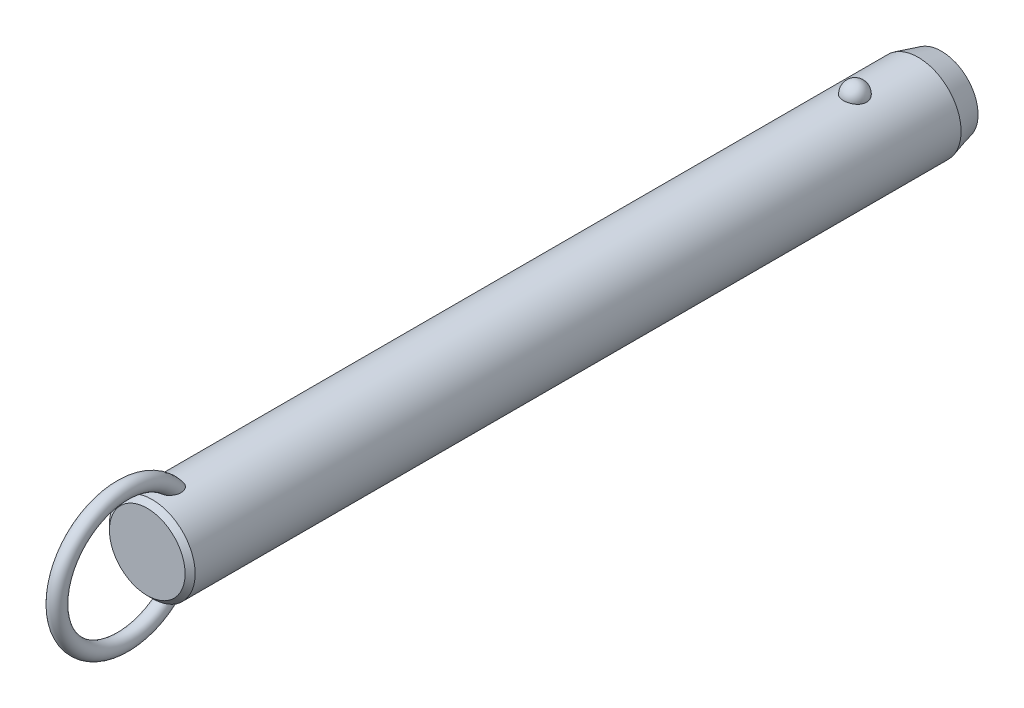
ISO-10303-21;
HEADER;
FILE_DESCRIPTION(('STEP AP214'),'2;1');
FILE_NAME('part.step','',(''),(''),'','','');
FILE_SCHEMA(('AUTOMOTIVE_DESIGN { 1 0 10303 214 1 1 1 1 }'));
ENDSEC;
DATA;
#1=APPLICATION_CONTEXT('core data for automotive mechanical design processes');
#2=APPLICATION_PROTOCOL_DEFINITION('international standard','automotive_design',2000,#1);
#3=PRODUCT_CONTEXT('',#1,'mechanical');
#4=PRODUCT('Part','Part','',(#3));
#5=PRODUCT_RELATED_PRODUCT_CATEGORY('part','',(#4));
#6=PRODUCT_DEFINITION_FORMATION('','',#4);
#7=PRODUCT_DEFINITION_CONTEXT('part definition',#1,'design');
#8=PRODUCT_DEFINITION('design','',#6,#7);
#9=PRODUCT_DEFINITION_SHAPE('','',#8);
#10=(LENGTH_UNIT() NAMED_UNIT(*) SI_UNIT(.MILLI.,.METRE.));
#11=(NAMED_UNIT(*) PLANE_ANGLE_UNIT() SI_UNIT($,.RADIAN.));
#12=(NAMED_UNIT(*) SI_UNIT($,.STERADIAN.) SOLID_ANGLE_UNIT());
#13=UNCERTAINTY_MEASURE_WITH_UNIT(LENGTH_MEASURE(1.E-05),#10,'distance_accuracy_value','');
#14=(GEOMETRIC_REPRESENTATION_CONTEXT(3) GLOBAL_UNCERTAINTY_ASSIGNED_CONTEXT((#13)) GLOBAL_UNIT_ASSIGNED_CONTEXT((#10,
#11,#12)) REPRESENTATION_CONTEXT('',''));
#15=CARTESIAN_POINT('',(0.,0.,0.));
#16=DIRECTION('',(0.,0.,1.));
#17=DIRECTION('',(1.,0.,0.));
#18=AXIS2_PLACEMENT_3D('',#15,#16,#17);
#19=CARTESIAN_POINT('',(0.,0.,167.6));
#20=DIRECTION('',(0.,0.,-1.));
#21=DIRECTION('',(-1.,0.,0.));
#22=AXIS2_PLACEMENT_3D('',#19,#20,#21);
#23=CYLINDRICAL_SURFACE('',#22,11.1);
#24=CARTESIAN_POINT('',(2.9724815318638,10.6945945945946,-3.00000000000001));
#25=CARTESIAN_POINT('',(2.97247830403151,10.6945972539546,-2.8322505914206));
#26=CARTESIAN_POINT('',(2.95876598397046,10.6984356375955,-2.66445972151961));
#27=CARTESIAN_POINT('',(2.90424529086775,10.7133624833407,-2.3336238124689));
#28=CARTESIAN_POINT('',(2.8634252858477,10.7244540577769,-2.17058084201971));
#29=CARTESIAN_POINT('',(2.75573657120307,10.7526272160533,-1.85396767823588));
#30=CARTESIAN_POINT('',(2.68887937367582,10.7697061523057,-1.70039333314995));
#31=CARTESIAN_POINT('',(2.53079696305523,10.8079438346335,-1.4069159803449));
#32=CARTESIAN_POINT('',(2.43957264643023,10.8291024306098,-1.26701246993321));
#33=CARTESIAN_POINT('',(2.23458150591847,10.8732541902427,-1.00409565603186));
#34=CARTESIAN_POINT('',(2.12071295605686,10.8962553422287,-0.881162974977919));
#35=CARTESIAN_POINT('',(1.87365402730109,10.9414421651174,-0.656352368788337));
#36=CARTESIAN_POINT('',(1.74046358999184,10.9636278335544,-0.554474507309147));
#37=CARTESIAN_POINT('',(1.45872188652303,11.0046495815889,-0.374872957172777));
#38=CARTESIAN_POINT('',(1.31021276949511,11.0234944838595,-0.297085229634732));
#39=CARTESIAN_POINT('',(1.00170030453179,11.0557957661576,-0.167529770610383));
#40=CARTESIAN_POINT('',(0.841698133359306,11.0692526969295,-0.1157593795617));
#41=CARTESIAN_POINT('',(0.517607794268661,11.0890932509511,-0.0403925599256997));
#42=CARTESIAN_POINT('',(0.353633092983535,11.0955916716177,-0.0163383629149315));
#43=CARTESIAN_POINT('',(0.0238420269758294,11.1011989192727,0.00445177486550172));
#44=CARTESIAN_POINT('',(-0.141974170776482,11.1003084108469,0.00119017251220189));
#45=CARTESIAN_POINT('',(-0.468405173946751,11.0912990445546,-0.0323233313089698));
#46=CARTESIAN_POINT('',(-0.629059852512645,11.0832767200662,-0.062214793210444));
#47=CARTESIAN_POINT('',(-0.942937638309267,11.0609962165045,-0.147645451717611));
#48=CARTESIAN_POINT('',(-1.09616062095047,11.0467379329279,-0.203185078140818));
#49=CARTESIAN_POINT('',(-1.39181061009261,11.0134071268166,-0.338752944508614));
#50=CARTESIAN_POINT('',(-1.53417383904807,10.9943086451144,-0.418913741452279));
#51=CARTESIAN_POINT('',(-1.80342160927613,10.9533667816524,-0.601448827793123));
#52=CARTESIAN_POINT('',(-1.9303046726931,10.9315231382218,-0.703825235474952));
#53=CARTESIAN_POINT('',(-2.16747598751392,10.887005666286,-0.930091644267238));
#54=CARTESIAN_POINT('',(-2.27742774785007,10.8643239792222,-1.05433291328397));
#55=CARTESIAN_POINT('',(-2.47517316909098,10.8209886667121,-1.31966633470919));
#56=CARTESIAN_POINT('',(-2.56296538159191,10.8003351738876,-1.46075958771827));
#57=CARTESIAN_POINT('',(-2.71500300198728,10.7631304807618,-1.75753646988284));
#58=CARTESIAN_POINT('',(-2.77898901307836,10.7466250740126,-1.91335887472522));
#59=CARTESIAN_POINT('',(-2.88046189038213,10.7198747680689,-2.23391529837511));
#60=CARTESIAN_POINT('',(-2.91794947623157,10.709629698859,-2.3986490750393));
#61=CARTESIAN_POINT('',(-2.96537819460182,10.6965949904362,-2.73165170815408));
#62=CARTESIAN_POINT('',(-2.97542891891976,10.693775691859,-2.89990378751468));
#63=CARTESIAN_POINT('',(-2.96804271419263,10.6958279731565,-3.23575286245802));
#64=CARTESIAN_POINT('',(-2.95060646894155,10.7006993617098,-3.4033498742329));
#65=CARTESIAN_POINT('',(-2.88883358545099,10.71753912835,-3.73233906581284));
#66=CARTESIAN_POINT('',(-2.84462026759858,10.7294749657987,-3.89375610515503));
#67=CARTESIAN_POINT('',(-2.73050447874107,10.7590797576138,-4.20667949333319));
#68=CARTESIAN_POINT('',(-2.66060103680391,10.7767489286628,-4.35818546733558));
#69=CARTESIAN_POINT('',(-2.49642559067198,10.8159599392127,-4.64785421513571));
#70=CARTESIAN_POINT('',(-2.40203047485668,10.8375211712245,-4.78594458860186));
#71=CARTESIAN_POINT('',(-2.19143488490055,10.8820570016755,-5.04410382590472));
#72=CARTESIAN_POINT('',(-2.07523364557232,10.9050316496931,-5.16417205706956));
#73=CARTESIAN_POINT('',(-1.82361254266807,10.9499219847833,-5.3833483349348));
#74=CARTESIAN_POINT('',(-1.68812945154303,10.9718338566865,-5.48238464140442));
#75=CARTESIAN_POINT('',(-1.40191298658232,11.0120611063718,-5.65618873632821));
#76=CARTESIAN_POINT('',(-1.25118062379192,11.0303767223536,-5.73095813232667));
#77=CARTESIAN_POINT('',(-0.940570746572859,11.0611653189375,-5.85334725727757));
#78=CARTESIAN_POINT('',(-0.780821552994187,11.0737044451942,-5.90127578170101));
#79=CARTESIAN_POINT('',(-0.455204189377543,11.0918598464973,-5.96992976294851));
#80=CARTESIAN_POINT('',(-0.289336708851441,11.0974768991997,-5.99065827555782));
#81=CARTESIAN_POINT('',(0.0406846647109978,11.1011307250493,-6.00418773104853));
#82=CARTESIAN_POINT('',(0.204817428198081,11.099299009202,-5.9974731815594));
#83=CARTESIAN_POINT('',(0.5295530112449,11.088551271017,-5.95740317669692));
#84=CARTESIAN_POINT('',(0.69015594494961,11.0796354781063,-5.92404858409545));
#85=CARTESIAN_POINT('',(1.0027760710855,11.0557204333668,-5.83180084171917));
#86=CARTESIAN_POINT('',(1.15482001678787,11.0407414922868,-5.7729929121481));
#87=CARTESIAN_POINT('',(1.44678373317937,11.0062913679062,-5.63147366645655));
#88=CARTESIAN_POINT('',(1.58670279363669,10.9868199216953,-5.54876095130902));
#89=CARTESIAN_POINT('',(1.8527023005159,10.9451315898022,-5.36027644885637));
#90=CARTESIAN_POINT('',(1.97855158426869,10.9228788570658,-5.25418644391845));
#91=CARTESIAN_POINT('',(2.21080872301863,10.8782509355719,-5.02251354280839));
#92=CARTESIAN_POINT('',(2.31721312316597,10.8558757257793,-4.89692718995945));
#93=CARTESIAN_POINT('',(2.5094551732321,10.8130715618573,-4.62745408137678));
#94=CARTESIAN_POINT('',(2.59493284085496,10.7926798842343,-4.48330448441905));
#95=CARTESIAN_POINT('',(2.740862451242,10.7565495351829,-4.18236358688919));
#96=CARTESIAN_POINT('',(2.80132490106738,10.7408089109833,-4.02557762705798));
#97=CARTESIAN_POINT('',(2.88959070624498,10.7173718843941,-3.72475308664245));
#98=CARTESIAN_POINT('',(2.92062102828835,10.7088950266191,-3.58171216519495));
#99=CARTESIAN_POINT('',(2.96206765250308,10.6975052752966,-3.29245795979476));
#100=CARTESIAN_POINT('',(2.97248434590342,10.6945922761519,-3.14624473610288));
#101=CARTESIAN_POINT('',(2.9724815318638,10.6945945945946,-3.00000000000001));
#102=B_SPLINE_CURVE_WITH_KNOTS('',3,(#24,#25,#26,#27,#28,#29,#30,#31,#32,#33,#34,#35,#36,#37,
#38,#39,#40,#41,#42,#43,#44,#45,#46,#47,#48,#49,#50,#51,#52,#53,#54,#55,#56,#57,#58,#59,#60,#61,
#62,#63,#64,#65,#66,#67,#68,#69,#70,#71,#72,#73,#74,#75,#76,#77,#78,#79,#80,#81,#82,#83,#84,#85,
#86,#87,#88,#89,#90,#91,#92,#93,#94,#95,#96,#97,#98,#99,#100,#101),.UNSPECIFIED.,.T.,.F.,(4,2,2,
2,2,2,2,2,2,2,2,2,2,2,2,2,2,2,2,2,2,2,2,2,2,2,2,2,2,2,2,2,2,2,2,2,2,2,4),(0.,0.502722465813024,
1.00566079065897,1.5083769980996,2.01107471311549,2.51608392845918,3.02109467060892,
3.52475118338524,4.02835620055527,4.523518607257,5.0186364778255,5.50715297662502,
5.9956776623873,6.48688002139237,6.97812923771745,7.47814366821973,7.9781907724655,
8.48353712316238,8.9888697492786,9.49218093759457,9.99547960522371,10.4964777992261,
10.997494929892,11.5010810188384,12.0046847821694,12.5099796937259,13.0152411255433,
13.5145635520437,14.0138298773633,14.5043200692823,14.9947943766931,15.4836390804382,
15.9725123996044,16.4685040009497,16.9645836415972,17.4686765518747,17.972557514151,
18.410841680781,18.849117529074),.UNSPECIFIED.);
#103=CARTESIAN_POINT('',(2.9724815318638,10.6945945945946,-3.00000000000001));
#104=VERTEX_POINT('',#103);
#105=EDGE_CURVE('E41',#104,#104,#102,.T.);
#106=ORIENTED_EDGE('',*,*,#105,.T.);
#107=EDGE_LOOP('',(#106));
#108=FACE_BOUND('',#107,.T.);
#109=CARTESIAN_POINT('',(0.,0.,179.));
#110=DIRECTION('',(0.,0.,1.));
#111=DIRECTION('',(1.,0.,0.));
#112=AXIS2_PLACEMENT_3D('',#109,#110,#111);
#113=CIRCLE('',#112,11.1);
#114=CARTESIAN_POINT('',(11.1,0.,179.));
#115=VERTEX_POINT('',#114);
#116=EDGE_CURVE('E10',#115,#115,#113,.F.);
#117=ORIENTED_EDGE('',*,*,#116,.T.);
#118=EDGE_LOOP('',(#117));
#119=FACE_BOUND('',#118,.T.);
#120=CARTESIAN_POINT('',(-0.564520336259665,-11.0856356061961,171.257815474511));
#121=CARTESIAN_POINT('',(-0.667202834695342,-11.0804062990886,171.291283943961));
#122=CARTESIAN_POINT('',(-0.766875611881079,-11.0738877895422,171.333835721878));
#123=CARTESIAN_POINT('',(-0.957284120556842,-11.0590576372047,171.435419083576));
#124=CARTESIAN_POINT('',(-1.04801616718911,-11.0507452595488,171.49445742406));
#125=CARTESIAN_POINT('',(-1.21800952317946,-11.0333016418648,171.626529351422));
#126=CARTESIAN_POINT('',(-1.29730805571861,-11.0241732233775,171.699515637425));
#127=CARTESIAN_POINT('',(-1.44337665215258,-11.0060026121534,171.857037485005));
#128=CARTESIAN_POINT('',(-1.51014622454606,-10.9969604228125,171.941573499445));
#129=CARTESIAN_POINT('',(-1.63454620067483,-10.9791841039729,172.125521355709));
#130=CARTESIAN_POINT('',(-1.69127003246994,-10.9705107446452,172.225549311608));
#131=CARTESIAN_POINT('',(-1.7898078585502,-10.9548648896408,172.432790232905));
#132=CARTESIAN_POINT('',(-1.83161214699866,-10.9478935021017,172.540007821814));
#133=CARTESIAN_POINT('',(-1.91557028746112,-10.9335803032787,172.805408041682));
#134=CARTESIAN_POINT('',(-1.95040620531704,-10.9273269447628,172.965980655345));
#135=CARTESIAN_POINT('',(-1.99388326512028,-10.9194709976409,173.290697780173));
#136=CARTESIAN_POINT('',(-2.00248051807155,-10.9178762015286,173.454847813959));
#137=CARTESIAN_POINT('',(-1.99551615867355,-10.9191578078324,173.824650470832));
#138=CARTESIAN_POINT('',(-1.9732206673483,-10.9232807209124,174.030191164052));
#139=CARTESIAN_POINT('',(-1.9152976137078,-10.9335244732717,174.333595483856));
#140=CARTESIAN_POINT('',(-1.89184575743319,-10.9376266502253,174.434088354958));
#141=CARTESIAN_POINT('',(-1.83700674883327,-10.9469720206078,174.632855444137));
#142=CARTESIAN_POINT('',(-1.80562070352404,-10.9522150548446,174.731129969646));
#143=CARTESIAN_POINT('',(-1.73463055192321,-10.9636837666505,174.925914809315));
#144=CARTESIAN_POINT('',(-1.69493416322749,-10.9699202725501,175.022390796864));
#145=CARTESIAN_POINT('',(-1.60745141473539,-10.9830806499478,175.211626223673));
#146=CARTESIAN_POINT('',(-1.55966150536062,-10.9900048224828,175.304384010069));
#147=CARTESIAN_POINT('',(-1.45591812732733,-11.0042280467,175.484690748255));
#148=CARTESIAN_POINT('',(-1.40000013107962,-11.0115253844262,175.572260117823));
#149=CARTESIAN_POINT('',(-1.27937470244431,-11.0261911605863,175.741029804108));
#150=CARTESIAN_POINT('',(-1.21467835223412,-11.0335594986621,175.82223795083));
#151=CARTESIAN_POINT('',(-1.08218150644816,-11.0473027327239,175.969001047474));
#152=CARTESIAN_POINT('',(-1.01522633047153,-11.0537063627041,176.035309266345));
#153=CARTESIAN_POINT('',(-0.872952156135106,-11.065850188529,176.158378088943));
#154=CARTESIAN_POINT('',(-0.797642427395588,-11.0715911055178,176.215149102));
#155=CARTESIAN_POINT('',(-0.651396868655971,-11.081071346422,176.307515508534));
#156=CARTESIAN_POINT('',(-0.581712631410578,-11.0849841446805,176.345049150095));
#157=CARTESIAN_POINT('',(-0.437066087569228,-11.0916271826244,176.408259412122));
#158=CARTESIAN_POINT('',(-0.362109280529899,-11.0943586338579,176.433948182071));
#159=CARTESIAN_POINT('',(-0.207828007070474,-11.0983242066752,176.471117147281));
#160=CARTESIAN_POINT('',(-0.12846771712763,-11.0995432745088,176.482454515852));
#161=CARTESIAN_POINT('',(0.0309101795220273,-11.1002423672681,176.488965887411));
#162=CARTESIAN_POINT('',(0.110927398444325,-11.0997233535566,176.484148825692));
#163=CARTESIAN_POINT('',(0.25640659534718,-11.097240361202,176.460959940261));
#164=CARTESIAN_POINT('',(0.322235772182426,-11.0955074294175,176.444754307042));
#165=CARTESIAN_POINT('',(0.450635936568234,-11.0910350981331,176.402600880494));
#166=CARTESIAN_POINT('',(0.513205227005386,-11.0882951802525,176.376648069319));
#167=CARTESIAN_POINT('',(0.662626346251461,-11.0805620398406,176.302607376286));
#168=CARTESIAN_POINT('',(0.747127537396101,-11.0751144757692,176.249845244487));
#169=CARTESIAN_POINT('',(0.906756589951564,-11.0631932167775,176.131720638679));
#170=CARTESIAN_POINT('',(0.981859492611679,-11.0567168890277,176.066325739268));
#171=CARTESIAN_POINT('',(1.10712207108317,-11.0447856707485,175.94226337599));
#172=CARTESIAN_POINT('',(1.15909566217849,-11.0394280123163,175.885383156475));
#173=CARTESIAN_POINT('',(1.25791923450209,-11.0286040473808,175.767327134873));
#174=CARTESIAN_POINT('',(1.30476642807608,-11.0231376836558,175.706149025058));
#175=CARTESIAN_POINT('',(1.43818612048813,-11.0068027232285,175.517305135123));
#176=CARTESIAN_POINT('',(1.51751767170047,-10.9960104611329,175.384453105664));
#177=CARTESIAN_POINT('',(1.63597546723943,-10.9788847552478,175.153137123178));
#178=CARTESIAN_POINT('',(1.67988876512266,-10.9722190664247,175.057053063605));
#179=CARTESIAN_POINT('',(1.75953241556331,-10.9597298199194,174.861431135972));
#180=CARTESIAN_POINT('',(1.79525967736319,-10.9539065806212,174.761891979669));
#181=CARTESIAN_POINT('',(1.85844731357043,-10.9433632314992,174.56021118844));
#182=CARTESIAN_POINT('',(1.8859107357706,-10.9386427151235,174.45807052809));
#183=CARTESIAN_POINT('',(1.93234324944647,-10.9305350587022,174.251819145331));
#184=CARTESIAN_POINT('',(1.95131065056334,-10.9271481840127,174.147708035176));
#185=CARTESIAN_POINT('',(1.9904020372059,-10.9201183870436,173.865458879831));
#186=CARTESIAN_POINT('',(2.00221217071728,-10.9179256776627,173.686037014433));
#187=CARTESIAN_POINT('',(1.99711676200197,-10.9188636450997,173.327713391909));
#188=CARTESIAN_POINT('',(1.98026150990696,-10.9219849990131,173.148811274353));
#189=CARTESIAN_POINT('',(1.92151657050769,-10.9324473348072,172.83645144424));
#190=CARTESIAN_POINT('',(1.88605081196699,-10.9386915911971,172.701759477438));
#191=CARTESIAN_POINT('',(1.79393020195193,-10.9541780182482,172.439966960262));
#192=CARTESIAN_POINT('',(1.73729868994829,-10.9634168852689,172.312858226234));
#193=CARTESIAN_POINT('',(1.61237037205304,-10.9824218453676,172.089418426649));
#194=CARTESIAN_POINT('',(1.54715374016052,-10.9918945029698,171.991345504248));
#195=CARTESIAN_POINT('',(1.40127026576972,-11.0114415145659,171.807434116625));
#196=CARTESIAN_POINT('',(1.32060742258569,-11.0215157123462,171.721592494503));
#197=CARTESIAN_POINT('',(1.1447478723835,-11.041168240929,171.565163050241));
#198=CARTESIAN_POINT('',(1.04947805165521,-11.0507437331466,171.494656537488));
#199=CARTESIAN_POINT('',(0.847278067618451,-11.0680789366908,171.372640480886));
#200=CARTESIAN_POINT('',(0.740351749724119,-11.0758392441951,171.321124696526));
#201=CARTESIAN_POINT('',(0.529289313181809,-11.0878275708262,171.243485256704));
#202=CARTESIAN_POINT('',(0.425895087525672,-11.0923259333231,171.215377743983));
#203=CARTESIAN_POINT('',(0.215723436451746,-11.0984001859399,171.177703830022));
#204=CARTESIAN_POINT('',(0.10894793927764,-11.0999777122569,171.168127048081));
#205=CARTESIAN_POINT('',(-0.0938962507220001,-11.1000196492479,171.167877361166));
#206=CARTESIAN_POINT('',(-0.189967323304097,-11.0987797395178,171.175408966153));
#207=CARTESIAN_POINT('',(-0.379657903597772,-11.0939111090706,171.205507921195));
#208=CARTESIAN_POINT('',(-0.473277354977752,-11.0902823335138,171.228075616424));
#209=CARTESIAN_POINT('',(-0.564520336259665,-11.0856356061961,171.257815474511));
#210=B_SPLINE_CURVE_WITH_KNOTS('',3,(#120,#121,#122,#123,#124,#125,#126,#127,#128,#129,#130,
#131,#132,#133,#134,#135,#136,#137,#138,#139,#140,#141,#142,#143,#144,#145,#146,#147,#148,#149,
#150,#151,#152,#153,#154,#155,#156,#157,#158,#159,#160,#161,#162,#163,#164,#165,#166,#167,#168,
#169,#170,#171,#172,#173,#174,#175,#176,#177,#178,#179,#180,#181,#182,#183,#184,#185,#186,#187,
#188,#189,#190,#191,#192,#193,#194,#195,#196,#197,#198,#199,#200,#201,#202,#203,#204,#205,#206,
#207,#208,#209),.UNSPECIFIED.,.T.,.F.,(4,2,2,2,2,2,2,2,2,2,2,2,2,2,2,2,2,2,2,2,2,2,2,2,2,2,2,2,
2,2,2,2,2,2,2,2,2,2,2,2,2,2,2,2,4),(0.,0.323999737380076,0.648132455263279,0.971184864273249,
1.29424994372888,1.63886237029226,1.98369857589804,2.47426059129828,2.96564271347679,
3.58257396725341,3.89215258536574,4.20168803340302,4.51486273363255,4.82817514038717,
5.14015911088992,5.45175282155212,5.73442856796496,6.01679375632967,6.25364580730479,
6.49025437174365,6.72919963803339,6.96801276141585,7.17061258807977,7.37331685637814,
7.67094989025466,7.96935728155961,8.20075067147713,8.43226927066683,8.89581623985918,
9.21306533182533,9.5304340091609,9.84768549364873,10.1650000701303,10.7022930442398,
11.2386443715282,11.655339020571,12.071575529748,12.4245637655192,12.7774607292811,
13.1321855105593,13.4867936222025,13.8068771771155,14.1267813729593,14.4146787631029,
14.7025827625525),.UNSPECIFIED.);
#211=CARTESIAN_POINT('',(-0.564520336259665,-11.0856356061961,171.257815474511));
#212=VERTEX_POINT('',#211);
#213=EDGE_CURVE('E60',#212,#212,#210,.T.);
#214=ORIENTED_EDGE('',*,*,#213,.T.);
#215=EDGE_LOOP('',(#214));
#216=FACE_BOUND('',#215,.T.);
#217=CARTESIAN_POINT('',(-0.564520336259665,11.0856356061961,171.257815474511));
#218=CARTESIAN_POINT('',(-0.468542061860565,11.0905203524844,171.226545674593));
#219=CARTESIAN_POINT('',(-0.369793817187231,11.0942886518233,171.203157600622));
#220=CARTESIAN_POINT('',(-0.169555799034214,11.0991586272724,171.173085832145));
#221=CARTESIAN_POINT('',(-0.0680604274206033,11.1002543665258,171.16643932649));
#222=CARTESIAN_POINT('',(0.13454973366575,11.099646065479,171.170157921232));
#223=CARTESIAN_POINT('',(0.235664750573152,11.0979441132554,171.18051033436));
#224=CARTESIAN_POINT('',(0.434632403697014,11.0919342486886,171.217831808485));
#225=CARTESIAN_POINT('',(0.532486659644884,11.0876276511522,171.244792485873));
#226=CARTESIAN_POINT('',(0.722445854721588,11.0768742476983,171.3144096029));
#227=CARTESIAN_POINT('',(0.814543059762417,11.0704246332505,171.357086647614));
#228=CARTESIAN_POINT('',(0.990565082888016,11.0560659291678,171.456648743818));
#229=CARTESIAN_POINT('',(1.07448844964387,11.048156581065,171.513536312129));
#230=CARTESIAN_POINT('',(1.23562672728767,11.0313221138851,171.642210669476));
#231=CARTESIAN_POINT('',(1.3124268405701,11.0223686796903,171.714511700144));
#232=CARTESIAN_POINT('',(1.45398030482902,11.0045918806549,171.870042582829));
#233=CARTESIAN_POINT('',(1.51873073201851,10.9957685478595,171.953275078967));
#234=CARTESIAN_POINT('',(1.64107232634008,10.9782087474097,172.136384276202));
#235=CARTESIAN_POINT('',(1.6974317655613,10.9695572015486,172.237089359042));
#236=CARTESIAN_POINT('',(1.79515063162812,10.9539887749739,172.445626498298));
#237=CARTESIAN_POINT('',(1.83649966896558,10.9470730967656,172.55346343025));
#238=CARTESIAN_POINT('',(1.91931148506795,10.9329211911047,172.820399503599));
#239=CARTESIAN_POINT('',(1.95340104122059,10.9267904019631,172.981861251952));
#240=CARTESIAN_POINT('',(1.99526195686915,10.9192174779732,173.30821631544));
#241=CARTESIAN_POINT('',(2.00298989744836,10.9177830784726,173.47311484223));
#242=CARTESIAN_POINT('',(1.99396251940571,10.9194420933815,173.844100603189));
#243=CARTESIAN_POINT('',(1.97050829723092,10.923774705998,174.05003871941));
#244=CARTESIAN_POINT('',(1.91079643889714,10.9343131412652,174.353901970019));
#245=CARTESIAN_POINT('',(1.88673702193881,10.9385106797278,174.454529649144));
#246=CARTESIAN_POINT('',(1.8306550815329,10.9480376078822,174.653510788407));
#247=CARTESIAN_POINT('',(1.79863369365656,10.9533668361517,174.751864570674));
#248=CARTESIAN_POINT('',(1.72633365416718,10.9649954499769,174.946720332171));
#249=CARTESIAN_POINT('',(1.68596409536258,10.9713053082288,175.04318790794));
#250=CARTESIAN_POINT('',(1.59707998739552,10.9845964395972,175.232323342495));
#251=CARTESIAN_POINT('',(1.54856169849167,10.9915780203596,175.324989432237));
#252=CARTESIAN_POINT('',(1.44330168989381,11.0058935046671,175.504975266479));
#253=CARTESIAN_POINT('',(1.3865974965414,11.0132257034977,175.592316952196));
#254=CARTESIAN_POINT('',(1.26431158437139,11.0279330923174,175.760456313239));
#255=CARTESIAN_POINT('',(1.19874160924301,11.0353082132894,175.841262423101));
#256=CARTESIAN_POINT('',(1.06542088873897,11.048931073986,175.985985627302));
#257=CARTESIAN_POINT('',(0.998640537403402,11.0552153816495,176.050784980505));
#258=CARTESIAN_POINT('',(0.856896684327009,11.0671032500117,176.170846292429));
#259=CARTESIAN_POINT('',(0.781942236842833,11.0727075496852,176.226118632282));
#260=CARTESIAN_POINT('',(0.636276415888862,11.081949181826,176.315972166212));
#261=CARTESIAN_POINT('',(0.566755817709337,11.0857572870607,176.352441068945));
#262=CARTESIAN_POINT('',(0.42260242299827,11.0921860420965,176.413533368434));
#263=CARTESIAN_POINT('',(0.347974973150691,11.0948079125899,176.438168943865));
#264=CARTESIAN_POINT('',(0.194593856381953,11.0985608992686,176.473323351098));
#265=CARTESIAN_POINT('',(0.115807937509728,11.0996777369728,176.483706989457));
#266=CARTESIAN_POINT('',(-0.0422499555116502,11.1002003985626,176.488574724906));
#267=CARTESIAN_POINT('',(-0.121521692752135,11.09960699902,176.483066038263));
#268=CARTESIAN_POINT('',(-0.266046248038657,11.0970123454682,176.458827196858));
#269=CARTESIAN_POINT('',(-0.331661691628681,11.0952283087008,176.442135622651));
#270=CARTESIAN_POINT('',(-0.45958809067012,11.0906663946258,176.399111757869));
#271=CARTESIAN_POINT('',(-0.52189737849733,11.0878880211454,176.372774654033));
#272=CARTESIAN_POINT('',(-0.671446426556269,11.0800342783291,176.297513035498));
#273=CARTESIAN_POINT('',(-0.756250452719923,11.0744969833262,176.243818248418));
#274=CARTESIAN_POINT('',(-0.916349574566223,11.0624045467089,176.123802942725));
#275=CARTESIAN_POINT('',(-0.991618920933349,11.0558467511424,176.057449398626));
#276=CARTESIAN_POINT('',(-1.11713140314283,11.0437783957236,175.931633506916));
#277=CARTESIAN_POINT('',(-1.16920539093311,11.0383619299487,175.873952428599));
#278=CARTESIAN_POINT('',(-1.26817476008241,11.02743010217,175.754280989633));
#279=CARTESIAN_POINT('',(-1.31506731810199,11.0219146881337,175.692288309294));
#280=CARTESIAN_POINT('',(-1.40399813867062,11.0109399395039,175.564784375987));
#281=CARTESIAN_POINT('',(-1.44602864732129,11.0054807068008,175.499267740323));
#282=CARTESIAN_POINT('',(-1.52538779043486,10.9947621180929,175.365422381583));
#283=CARTESIAN_POINT('',(-1.56271516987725,10.9895028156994,175.297092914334));
#284=CARTESIAN_POINT('',(-1.64537943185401,10.9774790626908,175.133210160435));
#285=CARTESIAN_POINT('',(-1.68879497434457,10.9708503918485,175.0366735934));
#286=CARTESIAN_POINT('',(-1.76740738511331,10.9584602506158,174.840236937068));
#287=CARTESIAN_POINT('',(-1.80260120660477,10.95269910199,174.74033561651));
#288=CARTESIAN_POINT('',(-1.86468657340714,10.9423003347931,174.537966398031));
#289=CARTESIAN_POINT('',(-1.8915816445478,10.9376622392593,174.435499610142));
#290=CARTESIAN_POINT('',(-1.93682458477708,10.9297405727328,174.228642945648));
#291=CARTESIAN_POINT('',(-1.95517082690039,10.9264572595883,174.124252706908));
#292=CARTESIAN_POINT('',(-1.99232562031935,10.9197647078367,173.84262876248));
#293=CARTESIAN_POINT('',(-2.00294603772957,10.9177914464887,173.664185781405));
#294=CARTESIAN_POINT('',(-1.99566675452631,10.9191290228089,173.307996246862));
#295=CARTESIAN_POINT('',(-1.97781651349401,10.9224306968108,173.13024902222));
#296=CARTESIAN_POINT('',(-1.91747214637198,10.9331592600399,172.819792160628));
#297=CARTESIAN_POINT('',(-1.88131022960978,10.9395108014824,172.685825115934));
#298=CARTESIAN_POINT('',(-1.78790380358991,10.9551659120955,172.42559757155));
#299=CARTESIAN_POINT('',(-1.73068309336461,10.9644661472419,172.299328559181));
#300=CARTESIAN_POINT('',(-1.60475573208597,10.9835398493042,172.07741565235));
#301=CARTESIAN_POINT('',(-1.53908879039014,10.9930297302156,171.980026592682));
#302=CARTESIAN_POINT('',(-1.39238608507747,11.0125708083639,171.797525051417));
#303=CARTESIAN_POINT('',(-1.31135150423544,11.0226219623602,171.712411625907));
#304=CARTESIAN_POINT('',(-1.14382035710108,11.0411991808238,171.56529943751));
#305=CARTESIAN_POINT('',(-1.0585850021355,11.0497792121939,171.50186930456));
#306=CARTESIAN_POINT('',(-0.878723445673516,11.0655285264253,171.390250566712));
#307=CARTESIAN_POINT('',(-0.784123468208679,11.0727015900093,171.342020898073));
#308=CARTESIAN_POINT('',(-0.646163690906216,11.0812501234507,171.286023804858));
#309=CARTESIAN_POINT('',(-0.605595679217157,11.0835451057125,171.271197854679));
#310=CARTESIAN_POINT('',(-0.564520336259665,11.0856356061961,171.257815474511));
#311=B_SPLINE_CURVE_WITH_KNOTS('',3,(#217,#218,#219,#220,#221,#222,#223,#224,#225,#226,#227,
#228,#229,#230,#231,#232,#233,#234,#235,#236,#237,#238,#239,#240,#241,#242,#243,#244,#245,#246,
#247,#248,#249,#250,#251,#252,#253,#254,#255,#256,#257,#258,#259,#260,#261,#262,#263,#264,#265,
#266,#267,#268,#269,#270,#271,#272,#273,#274,#275,#276,#277,#278,#279,#280,#281,#282,#283,#284,
#285,#286,#287,#288,#289,#290,#291,#292,#293,#294,#295,#296,#297,#298,#299,#300,#301,#302,#303,
#304,#305,#306,#307,#308,#309,#310),.UNSPECIFIED.,.T.,.F.,(4,2,2,2,2,2,2,2,2,2,2,2,2,2,2,2,2,2,
2,2,2,2,2,2,2,2,2,2,2,2,2,2,2,2,2,2,2,2,2,2,2,2,2,2,2,2,4),(0.,0.303061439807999,
0.606795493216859,0.910302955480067,1.21365733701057,1.51741085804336,1.82121821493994,
2.13745205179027,2.45376252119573,2.79958678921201,3.14564996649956,3.63832391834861,
4.13180893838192,4.75031912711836,5.06071926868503,5.37107516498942,5.68500772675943,
5.99908475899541,6.31176519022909,6.62403542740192,6.90315673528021,7.18197194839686,
7.41687778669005,7.65154134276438,7.88841587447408,8.12518286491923,8.32752842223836,
8.52997509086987,8.82986421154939,9.13054668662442,9.36393502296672,9.59744991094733,
9.83133221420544,10.0652767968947,10.3830324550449,10.7009056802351,11.0186436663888,
11.3364420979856,11.8705925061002,12.4038159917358,12.8189662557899,13.2336487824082,
13.5857049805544,13.9377340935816,14.2561354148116,14.5736690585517,14.7033687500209),.UNSPECIFIED.);
#312=CARTESIAN_POINT('',(-0.564520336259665,11.0856356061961,171.257815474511));
#313=VERTEX_POINT('',#312);
#314=EDGE_CURVE('E68',#313,#313,#311,.T.);
#315=ORIENTED_EDGE('',*,*,#314,.T.);
#316=EDGE_LOOP('',(#315));
#317=FACE_BOUND('',#316,.T.);
#318=CARTESIAN_POINT('',(0.,0.,-19.3999999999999));
#319=DIRECTION('',(0.,0.,-1.));
#320=DIRECTION('',(-1.,0.,0.));
#321=AXIS2_PLACEMENT_3D('',#318,#319,#320);
#322=CIRCLE('',#321,11.1);
#323=CARTESIAN_POINT('',(-11.1,0.,-19.3999999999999));
#324=VERTEX_POINT('',#323);
#325=EDGE_CURVE('E57',#324,#324,#322,.F.);
#326=ORIENTED_EDGE('',*,*,#325,.T.);
#327=EDGE_LOOP('',(#326));
#328=FACE_BOUND('',#327,.T.);
#329=ADVANCED_FACE('F37',(#108,#119,#216,#317,#328),#23,.T.);
#330=CARTESIAN_POINT('',(0.,0.,-25.4));
#331=DIRECTION('',(0.,0.,-1.));
#332=DIRECTION('',(-1.,0.,0.));
#333=AXIS2_PLACEMENT_3D('',#330,#331,#332);
#334=PLANE('',#333);
#335=CARTESIAN_POINT('',(0.,0.,-25.4));
#336=DIRECTION('',(0.,0.,-1.));
#337=DIRECTION('',(-1.,0.,0.));
#338=AXIS2_PLACEMENT_3D('',#335,#336,#337);
#339=CIRCLE('',#338,9.49230484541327);
#340=CARTESIAN_POINT('',(-9.49230484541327,0.,-25.4));
#341=VERTEX_POINT('',#340);
#342=EDGE_CURVE('E67',#341,#341,#339,.T.);
#343=ORIENTED_EDGE('',*,*,#342,.T.);
#344=EDGE_LOOP('',(#343));
#345=FACE_BOUND('',#344,.T.);
#346=ADVANCED_FACE('F86',(#345),#334,.T.);
#347=CARTESIAN_POINT('',(0.,0.,-25.4));
#348=DIRECTION('',(0.,0.,1.));
#349=DIRECTION('',(1.,0.,0.));
#350=AXIS2_PLACEMENT_3D('',#347,#348,#349);
#351=CONICAL_SURFACE('',#350,9.49230484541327,0.261799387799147);
#352=ORIENTED_EDGE('',*,*,#325,.F.);
#353=EDGE_LOOP('',(#352));
#354=FACE_BOUND('',#353,.T.);
#355=ORIENTED_EDGE('',*,*,#342,.F.);
#356=EDGE_LOOP('',(#355));
#357=FACE_BOUND('',#356,.T.);
#358=ADVANCED_FACE('F84',(#354,#357),#351,.T.);
#359=CARTESIAN_POINT('',(0.,0.,180.3));
#360=DIRECTION('',(0.,0.,1.));
#361=DIRECTION('',(1.,0.,0.));
#362=AXIS2_PLACEMENT_3D('',#359,#360,#361);
#363=PLANE('',#362);
#364=CARTESIAN_POINT('',(0.,0.,180.3));
#365=DIRECTION('',(0.,0.,1.));
#366=DIRECTION('',(1.,0.,0.));
#367=AXIS2_PLACEMENT_3D('',#364,#365,#366);
#368=CIRCLE('',#367,9.79999999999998);
#369=CARTESIAN_POINT('',(9.79999999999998,0.,180.3));
#370=VERTEX_POINT('',#369);
#371=EDGE_CURVE('E50',#370,#370,#368,.T.);
#372=ORIENTED_EDGE('',*,*,#371,.T.);
#373=EDGE_LOOP('',(#372));
#374=FACE_BOUND('',#373,.T.);
#375=ADVANCED_FACE('F78',(#374),#363,.T.);
#376=CARTESIAN_POINT('',(0.,0.,186.65));
#377=DIRECTION('',(1.,0.,0.));
#378=DIRECTION('',(0.,0.,-1.));
#379=AXIS2_PLACEMENT_3D('',#376,#377,#378);
#380=TOROIDAL_SURFACE('',#379,17.05,2.);
#381=ORIENTED_EDGE('',*,*,#314,.F.);
#382=EDGE_LOOP('',(#381));
#383=FACE_BOUND('',#382,.T.);
#384=ORIENTED_EDGE('',*,*,#213,.F.);
#385=EDGE_LOOP('',(#384));
#386=FACE_BOUND('',#385,.T.);
#387=ADVANCED_FACE('F74',(#383,#386),#380,.T.);
#388=CARTESIAN_POINT('',(0.,0.,180.3));
#389=DIRECTION('',(0.,0.,-1.));
#390=DIRECTION('',(-1.,0.,0.));
#391=AXIS2_PLACEMENT_3D('',#388,#389,#390);
#392=CONICAL_SURFACE('',#391,9.79999999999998,0.785398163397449);
#393=ORIENTED_EDGE('',*,*,#116,.F.);
#394=EDGE_LOOP('',(#393));
#395=FACE_BOUND('',#394,.T.);
#396=ORIENTED_EDGE('',*,*,#371,.F.);
#397=EDGE_LOOP('',(#396));
#398=FACE_BOUND('',#397,.T.);
#399=ADVANCED_FACE('F39',(#395,#398),#392,.T.);
#400=CARTESIAN_POINT('',(0.,11.1,-3.00000000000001));
#401=DIRECTION('',(0.,1.,0.));
#402=DIRECTION('',(0.,0.,-1.));
#403=AXIS2_PLACEMENT_3D('',#400,#401,#402);
#404=SPHERICAL_SURFACE('',#403,3.);
#405=ORIENTED_EDGE('',*,*,#105,.F.);
#406=EDGE_LOOP('',(#405));
#407=FACE_BOUND('',#406,.T.);
#408=ADVANCED_FACE('F80',(#407),#404,.T.);
#409=CLOSED_SHELL('',(#329,#346,#358,#375,#387,#399,#408));
#410=MANIFOLD_SOLID_BREP('B2',#409);
#411=ADVANCED_BREP_SHAPE_REPRESENTATION('',(#18,#410),#14);
#412=SHAPE_DEFINITION_REPRESENTATION(#9,#411);
ENDSEC;
END-ISO-10303-21;
